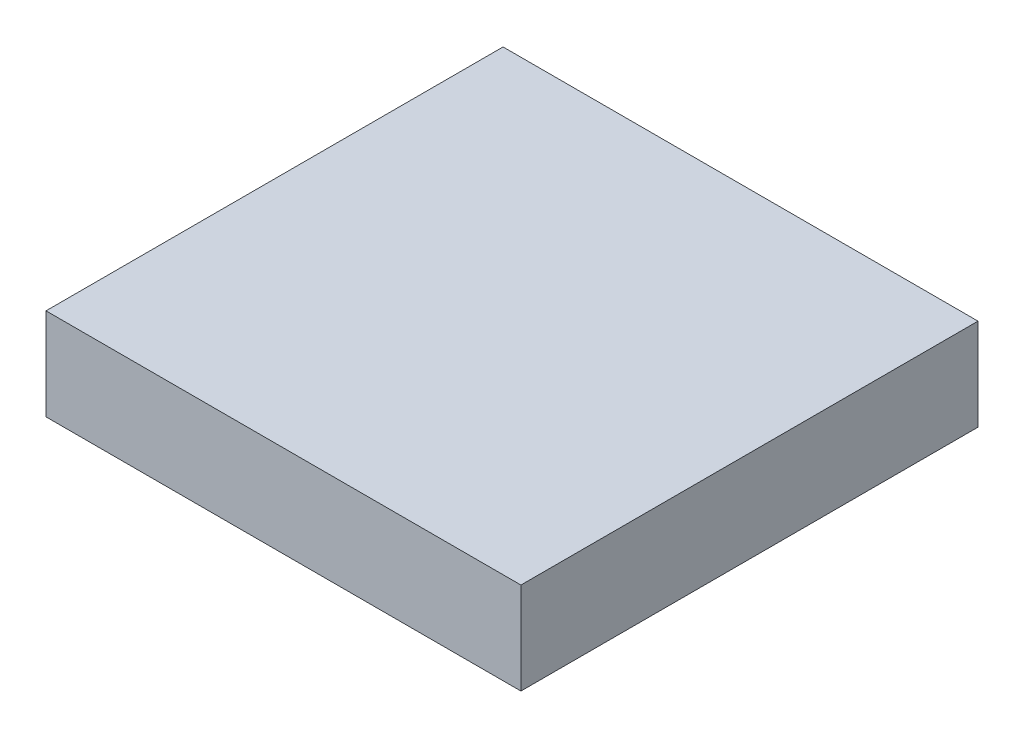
ISO-10303-21;
HEADER;
FILE_DESCRIPTION(('STEP AP214'),'2;1');
FILE_NAME('part.step','',(''),(''),'','','');
FILE_SCHEMA(('AUTOMOTIVE_DESIGN { 1 0 10303 214 1 1 1 1 }'));
ENDSEC;
DATA;
#1=APPLICATION_CONTEXT('core data for automotive mechanical design processes');
#2=APPLICATION_PROTOCOL_DEFINITION('international standard','automotive_design',2000,#1);
#3=PRODUCT_CONTEXT('',#1,'mechanical');
#4=PRODUCT('Part','Part','',(#3));
#5=PRODUCT_RELATED_PRODUCT_CATEGORY('part','',(#4));
#6=PRODUCT_DEFINITION_FORMATION('','',#4);
#7=PRODUCT_DEFINITION_CONTEXT('part definition',#1,'design');
#8=PRODUCT_DEFINITION('design','',#6,#7);
#9=PRODUCT_DEFINITION_SHAPE('','',#8);
#10=(LENGTH_UNIT() NAMED_UNIT(*) SI_UNIT(.MILLI.,.METRE.));
#11=(NAMED_UNIT(*) PLANE_ANGLE_UNIT() SI_UNIT($,.RADIAN.));
#12=(NAMED_UNIT(*) SI_UNIT($,.STERADIAN.) SOLID_ANGLE_UNIT());
#13=UNCERTAINTY_MEASURE_WITH_UNIT(LENGTH_MEASURE(1.E-05),#10,'distance_accuracy_value','');
#14=(GEOMETRIC_REPRESENTATION_CONTEXT(3) GLOBAL_UNCERTAINTY_ASSIGNED_CONTEXT((#13)) GLOBAL_UNIT_ASSIGNED_CONTEXT((#10,
#11,#12)) REPRESENTATION_CONTEXT('',''));
#15=CARTESIAN_POINT('',(0.,0.,0.));
#16=DIRECTION('',(0.,0.,1.));
#17=DIRECTION('',(1.,0.,0.));
#18=AXIS2_PLACEMENT_3D('',#15,#16,#17);
#19=CARTESIAN_POINT('',(0.,0.,196.330872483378));
#20=DIRECTION('',(1.,0.,0.));
#21=DIRECTION('',(0.,0.,-1.));
#22=AXIS2_PLACEMENT_3D('',#19,#20,#21);
#23=PLANE('',#22);
#24=DIRECTION('',(0.,-1.,0.));
#25=VECTOR('',#24,1.);
#26=CARTESIAN_POINT('',(0.,0.,0.));
#27=LINE('',#26,#25);
#28=CARTESIAN_POINT('',(0.,39.4484356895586,0.));
#29=VERTEX_POINT('',#28);
#30=CARTESIAN_POINT('',(0.,0.,0.));
#31=VERTEX_POINT('',#30);
#32=EDGE_CURVE('E97',#29,#31,#27,.T.);
#33=ORIENTED_EDGE('',*,*,#32,.T.);
#34=DIRECTION('',(0.,0.,-1.));
#35=VECTOR('',#34,1.);
#36=CARTESIAN_POINT('',(0.,0.,196.330872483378));
#37=LINE('',#36,#35);
#38=CARTESIAN_POINT('',(0.,0.,196.330872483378));
#39=VERTEX_POINT('',#38);
#40=EDGE_CURVE('E11',#39,#31,#37,.T.);
#41=ORIENTED_EDGE('',*,*,#40,.F.);
#42=DIRECTION('',(0.,-1.,0.));
#43=VECTOR('',#42,1.);
#44=CARTESIAN_POINT('',(0.,0.,196.330872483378));
#45=LINE('',#44,#43);
#46=CARTESIAN_POINT('',(0.,39.4484356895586,196.330872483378));
#47=VERTEX_POINT('',#46);
#48=EDGE_CURVE('E85',#47,#39,#45,.T.);
#49=ORIENTED_EDGE('',*,*,#48,.F.);
#50=DIRECTION('',(0.,0.,-1.));
#51=VECTOR('',#50,1.);
#52=CARTESIAN_POINT('',(0.,39.4484356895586,196.330872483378));
#53=LINE('',#52,#51);
#54=EDGE_CURVE('E93',#47,#29,#53,.T.);
#55=ORIENTED_EDGE('',*,*,#54,.T.);
#56=EDGE_LOOP('',(#33,#41,#49,#55));
#57=FACE_BOUND('',#56,.T.);
#58=ADVANCED_FACE('F34',(#57),#23,.F.);
#59=CARTESIAN_POINT('',(0.,0.,196.330872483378));
#60=DIRECTION('',(0.,1.,0.));
#61=DIRECTION('',(0.,0.,1.));
#62=AXIS2_PLACEMENT_3D('',#59,#60,#61);
#63=PLANE('',#62);
#64=DIRECTION('',(1.,0.,0.));
#65=VECTOR('',#64,1.);
#66=CARTESIAN_POINT('',(0.,0.,0.));
#67=LINE('',#66,#65);
#68=CARTESIAN_POINT('',(203.994456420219,0.,0.));
#69=VERTEX_POINT('',#68);
#70=EDGE_CURVE('E89',#31,#69,#67,.T.);
#71=ORIENTED_EDGE('',*,*,#70,.T.);
#72=DIRECTION('',(0.,0.,-1.));
#73=VECTOR('',#72,1.);
#74=CARTESIAN_POINT('',(203.994456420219,0.,196.330872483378));
#75=LINE('',#74,#73);
#76=CARTESIAN_POINT('',(203.994456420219,0.,196.330872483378));
#77=VERTEX_POINT('',#76);
#78=EDGE_CURVE('E42',#77,#69,#75,.T.);
#79=ORIENTED_EDGE('',*,*,#78,.F.);
#80=DIRECTION('',(1.,0.,0.));
#81=VECTOR('',#80,1.);
#82=CARTESIAN_POINT('',(0.,0.,196.330872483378));
#83=LINE('',#82,#81);
#84=EDGE_CURVE('E80',#39,#77,#83,.T.);
#85=ORIENTED_EDGE('',*,*,#84,.F.);
#86=ORIENTED_EDGE('',*,*,#40,.T.);
#87=EDGE_LOOP('',(#71,#79,#85,#86));
#88=FACE_BOUND('',#87,.T.);
#89=ADVANCED_FACE('F88',(#88),#63,.F.);
#90=CARTESIAN_POINT('',(203.994456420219,0.,196.330872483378));
#91=DIRECTION('',(-1.,0.,0.));
#92=DIRECTION('',(0.,0.,1.));
#93=AXIS2_PLACEMENT_3D('',#90,#91,#92);
#94=PLANE('',#93);
#95=DIRECTION('',(0.,1.,0.));
#96=VECTOR('',#95,1.);
#97=CARTESIAN_POINT('',(203.994456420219,0.,0.));
#98=LINE('',#97,#96);
#99=CARTESIAN_POINT('',(203.994456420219,39.4484356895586,0.));
#100=VERTEX_POINT('',#99);
#101=EDGE_CURVE('E67',#69,#100,#98,.T.);
#102=ORIENTED_EDGE('',*,*,#101,.T.);
#103=DIRECTION('',(0.,0.,-1.));
#104=VECTOR('',#103,1.);
#105=CARTESIAN_POINT('',(203.994456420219,39.4484356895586,196.330872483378));
#106=LINE('',#105,#104);
#107=CARTESIAN_POINT('',(203.994456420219,39.4484356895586,196.330872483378));
#108=VERTEX_POINT('',#107);
#109=EDGE_CURVE('E90',#108,#100,#106,.T.);
#110=ORIENTED_EDGE('',*,*,#109,.F.);
#111=DIRECTION('',(0.,1.,0.));
#112=VECTOR('',#111,1.);
#113=CARTESIAN_POINT('',(203.994456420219,0.,196.330872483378));
#114=LINE('',#113,#112);
#115=EDGE_CURVE('E83',#77,#108,#114,.T.);
#116=ORIENTED_EDGE('',*,*,#115,.F.);
#117=ORIENTED_EDGE('',*,*,#78,.T.);
#118=EDGE_LOOP('',(#102,#110,#116,#117));
#119=FACE_BOUND('',#118,.T.);
#120=ADVANCED_FACE('F91',(#119),#94,.F.);
#121=CARTESIAN_POINT('',(0.,39.4484356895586,196.330872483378));
#122=DIRECTION('',(0.,-1.,0.));
#123=DIRECTION('',(0.,0.,-1.));
#124=AXIS2_PLACEMENT_3D('',#121,#122,#123);
#125=PLANE('',#124);
#126=DIRECTION('',(-1.,0.,0.));
#127=VECTOR('',#126,1.);
#128=CARTESIAN_POINT('',(0.,39.4484356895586,0.));
#129=LINE('',#128,#127);
#130=EDGE_CURVE('E73',#100,#29,#129,.T.);
#131=ORIENTED_EDGE('',*,*,#130,.T.);
#132=ORIENTED_EDGE('',*,*,#54,.F.);
#133=DIRECTION('',(-1.,0.,0.));
#134=VECTOR('',#133,1.);
#135=CARTESIAN_POINT('',(0.,39.4484356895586,196.330872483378));
#136=LINE('',#135,#134);
#137=EDGE_CURVE('E50',#108,#47,#136,.T.);
#138=ORIENTED_EDGE('',*,*,#137,.F.);
#139=ORIENTED_EDGE('',*,*,#109,.T.);
#140=EDGE_LOOP('',(#131,#132,#138,#139));
#141=FACE_BOUND('',#140,.T.);
#142=ADVANCED_FACE('F104',(#141),#125,.F.);
#143=CARTESIAN_POINT('',(0.,39.4484356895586,196.330872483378));
#144=DIRECTION('',(0.,0.,-1.));
#145=DIRECTION('',(-1.,0.,0.));
#146=AXIS2_PLACEMENT_3D('',#143,#144,#145);
#147=PLANE('',#146);
#148=ORIENTED_EDGE('',*,*,#48,.T.);
#149=ORIENTED_EDGE('',*,*,#84,.T.);
#150=ORIENTED_EDGE('',*,*,#115,.T.);
#151=ORIENTED_EDGE('',*,*,#137,.T.);
#152=EDGE_LOOP('',(#148,#149,#150,#151));
#153=FACE_BOUND('',#152,.T.);
#154=ADVANCED_FACE('F81',(#153),#147,.F.);
#155=CARTESIAN_POINT('',(0.,39.4484356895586,0.));
#156=DIRECTION('',(0.,0.,-1.));
#157=DIRECTION('',(-1.,0.,0.));
#158=AXIS2_PLACEMENT_3D('',#155,#156,#157);
#159=PLANE('',#158);
#160=ORIENTED_EDGE('',*,*,#32,.F.);
#161=ORIENTED_EDGE('',*,*,#130,.F.);
#162=ORIENTED_EDGE('',*,*,#101,.F.);
#163=ORIENTED_EDGE('',*,*,#70,.F.);
#164=EDGE_LOOP('',(#160,#161,#162,#163));
#165=FACE_BOUND('',#164,.T.);
#166=ADVANCED_FACE('F107',(#165),#159,.T.);
#167=CLOSED_SHELL('',(#58,#89,#120,#142,#154,#166));
#168=MANIFOLD_SOLID_BREP('B2',#167);
#169=ADVANCED_BREP_SHAPE_REPRESENTATION('',(#18,#168),#14);
#170=SHAPE_DEFINITION_REPRESENTATION(#9,#169);
ENDSEC;
END-ISO-10303-21;
